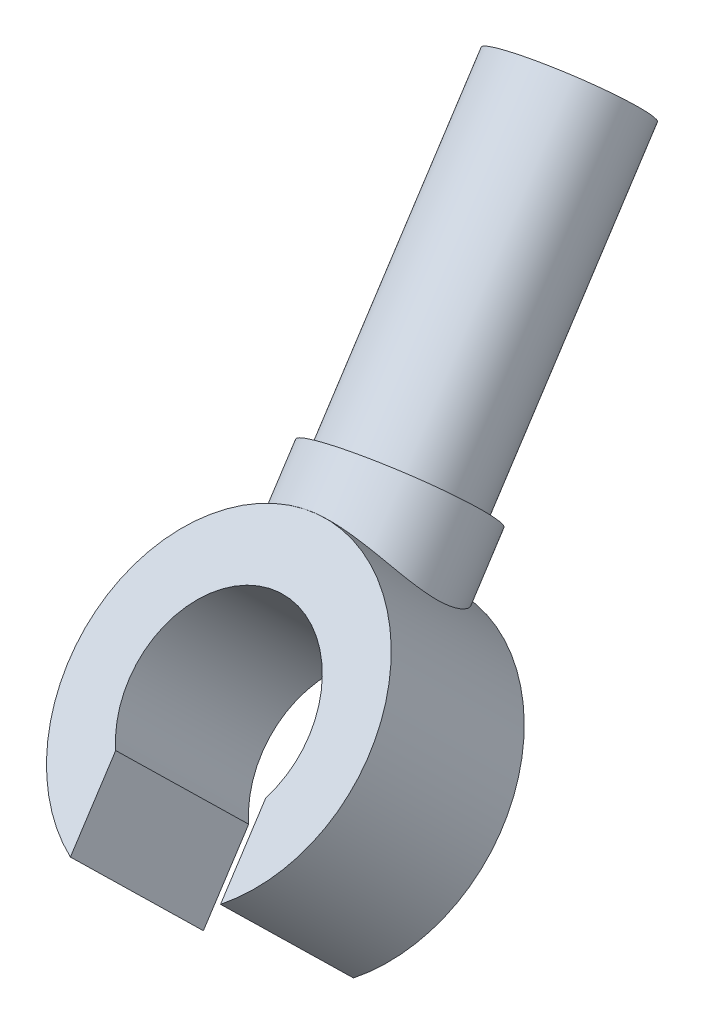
ISO-10303-21;
HEADER;
FILE_DESCRIPTION(('STEP AP214'),'2;1');
FILE_NAME('part.step','',(''),(''),'','','');
FILE_SCHEMA(('AUTOMOTIVE_DESIGN { 1 0 10303 214 1 1 1 1 }'));
ENDSEC;
DATA;
#1=APPLICATION_CONTEXT('core data for automotive mechanical design processes');
#2=APPLICATION_PROTOCOL_DEFINITION('international standard','automotive_design',2000,#1);
#3=PRODUCT_CONTEXT('',#1,'mechanical');
#4=PRODUCT('Part','Part','',(#3));
#5=PRODUCT_RELATED_PRODUCT_CATEGORY('part','',(#4));
#6=PRODUCT_DEFINITION_FORMATION('','',#4);
#7=PRODUCT_DEFINITION_CONTEXT('part definition',#1,'design');
#8=PRODUCT_DEFINITION('design','',#6,#7);
#9=PRODUCT_DEFINITION_SHAPE('','',#8);
#10=(LENGTH_UNIT() NAMED_UNIT(*) SI_UNIT(.MILLI.,.METRE.));
#11=(NAMED_UNIT(*) PLANE_ANGLE_UNIT() SI_UNIT($,.RADIAN.));
#12=(NAMED_UNIT(*) SI_UNIT($,.STERADIAN.) SOLID_ANGLE_UNIT());
#13=UNCERTAINTY_MEASURE_WITH_UNIT(LENGTH_MEASURE(1.E-05),#10,'distance_accuracy_value','');
#14=(GEOMETRIC_REPRESENTATION_CONTEXT(3) GLOBAL_UNCERTAINTY_ASSIGNED_CONTEXT((#13)) GLOBAL_UNIT_ASSIGNED_CONTEXT((#10,
#11,#12)) REPRESENTATION_CONTEXT('',''));
#15=CARTESIAN_POINT('',(0.,0.,0.));
#16=DIRECTION('',(0.,0.,1.));
#17=DIRECTION('',(1.,0.,0.));
#18=AXIS2_PLACEMENT_3D('',#15,#16,#17);
#19=CARTESIAN_POINT('',(15.2915894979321,14.3818385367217,7.90626678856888));
#20=DIRECTION('',(0.975131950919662,0.221625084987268,0.));
#21=DIRECTION('',(-0.156712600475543,0.689522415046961,0.707106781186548));
#22=AXIS2_PLACEMENT_3D('',#19,#20,#21);
#23=PLANE('',#22);
#24=DIRECTION('',(-0.156712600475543,0.689522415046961,0.707106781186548));
#25=VECTOR('',#24,1.);
#26=CARTESIAN_POINT('',(15.2033138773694,14.7702439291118,7.50795618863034));
#27=LINE('',#26,#25);
#28=CARTESIAN_POINT('',(15.5950953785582,13.0464378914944,5.74018923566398));
#29=VERTEX_POINT('',#28);
#30=CARTESIAN_POINT('',(15.2033138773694,14.7702439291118,7.50795618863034));
#31=VERTEX_POINT('',#30);
#32=EDGE_CURVE('E117',#29,#31,#27,.T.);
#33=ORIENTED_EDGE('',*,*,#32,.T.);
#34=DIRECTION('',(0.156712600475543,-0.689522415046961,0.707106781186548));
#35=VECTOR('',#34,1.);
#36=CARTESIAN_POINT('',(15.2915894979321,14.3818385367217,7.90626678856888));
#37=LINE('',#36,#35);
#38=CARTESIAN_POINT('',(14.9939603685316,15.6913819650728,6.56332706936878));
#39=VERTEX_POINT('',#38);
#40=EDGE_CURVE('E11',#39,#31,#37,.T.);
#41=ORIENTED_EDGE('',*,*,#40,.F.);
#42=DIRECTION('',(0.156712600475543,-0.689522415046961,-0.707106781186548));
#43=VECTOR('',#42,1.);
#44=CARTESIAN_POINT('',(14.9939603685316,15.6913819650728,6.56332706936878));
#45=LINE('',#44,#43);
#46=CARTESIAN_POINT('',(15.3857418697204,13.9675759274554,4.79556011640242));
#47=VERTEX_POINT('',#46);
#48=EDGE_CURVE('E120',#39,#47,#45,.T.);
#49=ORIENTED_EDGE('',*,*,#48,.T.);
#50=DIRECTION('',(0.156712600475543,-0.689522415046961,0.707106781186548));
#51=VECTOR('',#50,1.);
#52=CARTESIAN_POINT('',(15.6833709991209,12.6580324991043,6.13849983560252));
#53=LINE('',#52,#51);
#54=EDGE_CURVE('E107',#47,#29,#53,.T.);
#55=ORIENTED_EDGE('',*,*,#54,.T.);
#56=EDGE_LOOP('',(#33,#41,#49,#55));
#57=FACE_BOUND('',#56,.T.);
#58=ADVANCED_FACE('F17',(#57),#23,.F.);
#59=CARTESIAN_POINT('',(12.5561304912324,15.1373192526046,6.56332706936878));
#60=DIRECTION('',(-0.975131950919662,-0.221625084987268,0.));
#61=DIRECTION('',(0.156712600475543,-0.689522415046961,0.707106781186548));
#62=AXIS2_PLACEMENT_3D('',#59,#60,#61);
#63=PLANE('',#62);
#64=DIRECTION('',(0.156712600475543,-0.689522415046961,-0.707106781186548));
#65=VECTOR('',#64,1.);
#66=CARTESIAN_POINT('',(12.7654840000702,14.2161812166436,7.50795618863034));
#67=LINE('',#66,#65);
#68=CARTESIAN_POINT('',(12.7654840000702,14.2161812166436,7.50795618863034));
#69=VERTEX_POINT('',#68);
#70=CARTESIAN_POINT('',(13.1572655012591,12.4923751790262,5.74018923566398));
#71=VERTEX_POINT('',#70);
#72=EDGE_CURVE('E153',#69,#71,#67,.T.);
#73=ORIENTED_EDGE('',*,*,#72,.T.);
#74=DIRECTION('',(-0.156712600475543,0.689522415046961,-0.707106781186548));
#75=VECTOR('',#74,1.);
#76=CARTESIAN_POINT('',(12.9479119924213,13.4135132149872,4.79556011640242));
#77=LINE('',#76,#75);
#78=CARTESIAN_POINT('',(12.9479119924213,13.4135132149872,4.79556011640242));
#79=VERTEX_POINT('',#78);
#80=EDGE_CURVE('E168',#71,#79,#77,.T.);
#81=ORIENTED_EDGE('',*,*,#80,.T.);
#82=DIRECTION('',(0.156712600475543,-0.689522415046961,-0.707106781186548));
#83=VECTOR('',#82,1.);
#84=CARTESIAN_POINT('',(12.5561304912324,15.1373192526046,6.56332706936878));
#85=LINE('',#84,#83);
#86=CARTESIAN_POINT('',(12.5561304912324,15.1373192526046,6.56332706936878));
#87=VERTEX_POINT('',#86);
#88=EDGE_CURVE('E128',#87,#79,#85,.T.);
#89=ORIENTED_EDGE('',*,*,#88,.F.);
#90=DIRECTION('',(-0.156712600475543,0.689522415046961,-0.707106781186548));
#91=VECTOR('',#90,1.);
#92=CARTESIAN_POINT('',(12.5561304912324,15.1373192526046,6.56332706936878));
#93=LINE('',#92,#91);
#94=EDGE_CURVE('E28',#69,#87,#93,.T.);
#95=ORIENTED_EDGE('',*,*,#94,.F.);
#96=EDGE_LOOP('',(#73,#81,#89,#95));
#97=FACE_BOUND('',#96,.T.);
#98=ADVANCED_FACE('F300',(#97),#63,.F.);
#99=CARTESIAN_POINT('',(13.6451062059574,15.9860723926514,5.97702509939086));
#100=DIRECTION('',(0.156712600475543,-0.689522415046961,-0.707106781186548));
#101=DIRECTION('',(-0.156712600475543,0.689522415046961,-0.707106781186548));
#102=AXIS2_PLACEMENT_3D('',#99,#100,#101);
#103=PLANE('',#102);
#104=CARTESIAN_POINT('',(13.6451062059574,15.9860723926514,5.97702509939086));
#105=DIRECTION('',(0.156712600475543,-0.689522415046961,-0.707106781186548));
#106=DIRECTION('',(-0.156712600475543,0.689522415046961,-0.707106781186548));
#107=AXIS2_PLACEMENT_3D('',#104,#105,#106);
#108=CIRCLE('',#107,2.5);
#109=CARTESIAN_POINT('',(13.2533247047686,17.7098784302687,4.20925814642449));
#110=VERTEX_POINT('',#109);
#111=EDGE_CURVE('E157',#69,#110,#108,.T.);
#112=ORIENTED_EDGE('',*,*,#111,.F.);
#113=ORIENTED_EDGE('',*,*,#94,.T.);
#114=CARTESIAN_POINT('',(13.6451062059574,15.9860723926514,5.97702509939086));
#115=DIRECTION('',(0.156712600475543,-0.689522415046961,-0.707106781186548));
#116=DIRECTION('',(-0.156712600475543,0.689522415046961,-0.707106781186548));
#117=AXIS2_PLACEMENT_3D('',#114,#115,#116);
#118=CIRCLE('',#117,1.5);
#119=EDGE_CURVE('E135',#87,#39,#118,.T.);
#120=ORIENTED_EDGE('',*,*,#119,.T.);
#121=ORIENTED_EDGE('',*,*,#40,.T.);
#122=CARTESIAN_POINT('',(13.6451062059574,15.9860723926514,5.97702509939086));
#123=DIRECTION('',(0.156712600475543,-0.689522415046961,-0.707106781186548));
#124=DIRECTION('',(-0.156712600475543,0.689522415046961,-0.707106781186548));
#125=AXIS2_PLACEMENT_3D('',#122,#123,#124);
#126=CIRCLE('',#125,2.5);
#127=EDGE_CURVE('E144',#110,#31,#126,.T.);
#128=ORIENTED_EDGE('',*,*,#127,.F.);
#129=EDGE_LOOP('',(#112,#113,#120,#121,#128));
#130=FACE_BOUND('',#129,.T.);
#131=ADVANCED_FACE('F298',(#130),#103,.F.);
#132=CARTESIAN_POINT('',(13.6451062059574,15.9860723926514,5.97702509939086));
#133=DIRECTION('',(0.156712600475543,-0.689522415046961,-0.707106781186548));
#134=DIRECTION('',(-0.156712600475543,0.689522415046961,-0.707106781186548));
#135=AXIS2_PLACEMENT_3D('',#132,#133,#134);
#136=CYLINDRICAL_SURFACE('',#135,2.5);
#137=ORIENTED_EDGE('',*,*,#32,.F.);
#138=CARTESIAN_POINT('',(14.0368877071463,14.2622663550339,4.20925814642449));
#139=DIRECTION('',(0.156712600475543,-0.689522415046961,-0.707106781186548));
#140=DIRECTION('',(-0.156712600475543,0.689522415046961,-0.707106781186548));
#141=AXIS2_PLACEMENT_3D('',#138,#139,#140);
#142=CIRCLE('',#141,2.5);
#143=CARTESIAN_POINT('',(14.1405877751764,16.0620569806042,2.47720733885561));
#144=VERTEX_POINT('',#143);
#145=EDGE_CURVE('E113',#144,#29,#142,.T.);
#146=ORIENTED_EDGE('',*,*,#145,.F.);
#147=CARTESIAN_POINT('',(14.7818575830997,16.8502228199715,3.54781939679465));
#148=CARTESIAN_POINT('',(14.7838177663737,16.8415987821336,3.53897540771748));
#149=CARTESIAN_POINT('',(14.7855837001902,16.8330138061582,3.53005044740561));
#150=CARTESIAN_POINT('',(14.7887399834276,16.8158557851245,3.51197654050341));
#151=CARTESIAN_POINT('',(14.790127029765,16.8072834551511,3.50282633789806));
#152=CARTESIAN_POINT('',(14.792515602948,16.7901564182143,3.48430974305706));
#153=CARTESIAN_POINT('',(14.7935136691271,16.7816025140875,3.47494216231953));
#154=CARTESIAN_POINT('',(14.7951147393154,16.7645183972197,3.45599889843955));
#155=CARTESIAN_POINT('',(14.7957141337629,16.7559890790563,3.44642210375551));
#156=CARTESIAN_POINT('',(14.7965084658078,16.7389606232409,3.42706886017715));
#157=CARTESIAN_POINT('',(14.7966996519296,16.7304624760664,3.41729138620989));
#158=CARTESIAN_POINT('',(14.7966684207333,16.7135032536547,3.3975455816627));
#159=CARTESIAN_POINT('',(14.7964421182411,16.7050432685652,3.38757632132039));
#160=CARTESIAN_POINT('',(14.7955670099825,16.688167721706,3.36745606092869));
#161=CARTESIAN_POINT('',(14.7949141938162,16.6797533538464,3.35730423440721));
#162=CARTESIAN_POINT('',(14.7931774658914,16.6629766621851,3.33682840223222));
#163=CARTESIAN_POINT('',(14.7920894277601,16.6546156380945,3.32650368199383));
#164=CARTESIAN_POINT('',(14.789473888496,16.6379542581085,3.30569157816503));
#165=CARTESIAN_POINT('',(14.7879421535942,16.6296553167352,3.2952035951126));
#166=CARTESIAN_POINT('',(14.784431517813,16.6131249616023,3.27407627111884));
#167=CARTESIAN_POINT('',(14.7824482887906,16.6048950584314,3.26343646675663));
#168=CARTESIAN_POINT('',(14.7784449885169,16.5900696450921,3.24404108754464));
#169=CARTESIAN_POINT('',(14.7764959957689,16.5834469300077,3.23529157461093));
#170=CARTESIAN_POINT('',(14.7722327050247,16.5700655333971,3.21745036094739));
#171=CARTESIAN_POINT('',(14.7699074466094,16.5633110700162,3.20835813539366));
#172=CARTESIAN_POINT('',(14.7622066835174,16.5424848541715,3.18009111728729));
#173=CARTESIAN_POINT('',(14.7563077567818,16.5286036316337,3.16091476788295));
#174=CARTESIAN_POINT('',(14.7463135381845,16.5077819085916,3.13174221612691));
#175=CARTESIAN_POINT('',(14.7426886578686,16.5006702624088,3.12170305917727));
#176=CARTESIAN_POINT('',(14.7349591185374,16.4863419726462,3.10133791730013));
#177=CARTESIAN_POINT('',(14.7308425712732,16.4791296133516,3.09101340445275));
#178=CARTESIAN_POINT('',(14.7221005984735,16.464611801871,3.07009567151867));
#179=CARTESIAN_POINT('',(14.7174630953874,16.4573107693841,3.0595044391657));
#180=CARTESIAN_POINT('',(14.7076498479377,16.4426287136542,3.03807202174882));
#181=CARTESIAN_POINT('',(14.7024618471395,16.4352522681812,3.02723331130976));
#182=CARTESIAN_POINT('',(14.691518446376,16.4204338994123,3.00532672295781));
#183=CARTESIAN_POINT('',(14.6857506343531,16.4129967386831,2.99426182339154));
#184=CARTESIAN_POINT('',(14.6736186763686,16.3980745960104,2.97192454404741));
#185=CARTESIAN_POINT('',(14.6672419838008,16.3905946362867,2.96065562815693));
#186=CARTESIAN_POINT('',(14.6511383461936,16.372545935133,2.93330758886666));
#187=CARTESIAN_POINT('',(14.6411761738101,16.3620729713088,2.91730346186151));
#188=CARTESIAN_POINT('',(14.6174664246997,16.3385409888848,2.88125055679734));
#189=CARTESIAN_POINT('',(14.6034392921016,16.3255777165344,2.86132214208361));
#190=CARTESIAN_POINT('',(14.5801588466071,16.3054844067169,2.83035169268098));
#191=CARTESIAN_POINT('',(14.5713607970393,16.2981809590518,2.81907694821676));
#192=CARTESIAN_POINT('',(14.5527037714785,16.2832592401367,2.79604124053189));
#193=CARTESIAN_POINT('',(14.5428132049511,16.2756526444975,2.78429828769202));
#194=CARTESIAN_POINT('',(14.5160230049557,16.2558111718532,2.75371045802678));
#195=CARTESIAN_POINT('',(14.4986933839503,16.2437340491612,2.73513677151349));
#196=CARTESIAN_POINT('',(14.4679775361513,16.2235651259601,2.70421508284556));
#197=CARTESIAN_POINT('',(14.4549153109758,16.2153383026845,2.69163126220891));
#198=CARTESIAN_POINT('',(14.4314063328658,16.2010640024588,2.67000583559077));
#199=CARTESIAN_POINT('',(14.4210948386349,16.1949724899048,2.66084619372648));
#200=CARTESIAN_POINT('',(14.4004300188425,16.183099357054,2.64311982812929));
#201=CARTESIAN_POINT('',(14.3900870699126,16.1773139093,2.63454357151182));
#202=CARTESIAN_POINT('',(14.3693988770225,16.1660427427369,2.61796886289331));
#203=CARTESIAN_POINT('',(14.3590634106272,16.1605532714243,2.60996075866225));
#204=CARTESIAN_POINT('',(14.3384274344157,16.1498652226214,2.59450491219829));
#205=CARTESIAN_POINT('',(14.3281361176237,16.1446629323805,2.58704746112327));
#206=CARTESIAN_POINT('',(14.3076232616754,16.1345387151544,2.57267523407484));
#207=CARTESIAN_POINT('',(14.2974103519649,16.1296131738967,2.56575069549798));
#208=CARTESIAN_POINT('',(14.2770875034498,16.1200310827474,2.55242672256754));
#209=CARTESIAN_POINT('',(14.2669856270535,16.1153710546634,2.54601746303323));
#210=CARTESIAN_POINT('',(14.2374105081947,16.102017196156,2.52787425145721));
#211=CARTESIAN_POINT('',(14.2176487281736,16.0934493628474,2.51651360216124));
#212=CARTESIAN_POINT('',(14.1788510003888,16.0772463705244,2.49571472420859));
#213=CARTESIAN_POINT('',(14.1598671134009,16.06958874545,2.48619673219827));
#214=CARTESIAN_POINT('',(14.1405877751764,16.0620569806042,2.47720733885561));
#215=B_SPLINE_CURVE_WITH_KNOTS('',3,(#147,#148,#149,#150,#151,#152,#153,#154,#155,#156,#157,
#158,#159,#160,#161,#162,#163,#164,#165,#166,#167,#168,#169,#170,#171,#172,#173,#174,#175,#176,
#177,#178,#179,#180,#181,#182,#183,#184,#185,#186,#187,#188,#189,#190,#191,#192,#193,#194,#195,
#196,#197,#198,#199,#200,#201,#202,#203,#204,#205,#206,#207,#208,#209,#210,#211,#212,#213,#214),
.UNSPECIFIED.,.F.,.F.,(4,2,2,2,2,2,2,2,2,2,2,2,2,2,2,2,2,2,2,2,2,2,2,2,2,2,2,2,2,2,2,2,2,4),(0.,
0.0375198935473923,0.075357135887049,0.113523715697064,0.152031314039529,0.190891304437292,
0.230114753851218,0.269712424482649,0.309694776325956,0.350071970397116,0.39085387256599,
0.424284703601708,0.458969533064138,0.532111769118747,0.570584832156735,0.61032799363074,
0.651344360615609,0.693636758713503,0.737207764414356,0.782059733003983,0.846732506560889,
0.929489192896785,0.977655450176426,1.02904765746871,1.11337300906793,1.1731043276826,
1.21832882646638,1.2622074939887,1.30474191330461,1.34593382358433,1.38578514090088,
1.42429798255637,1.49731064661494,1.56500232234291),.UNSPECIFIED.);
#216=CARTESIAN_POINT('',(14.7818575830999,16.8502228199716,3.54781939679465));
#217=VERTEX_POINT('',#216);
#218=EDGE_CURVE('E177',#217,#144,#215,.T.);
#219=ORIENTED_EDGE('',*,*,#218,.F.);
#220=CARTESIAN_POINT('',(13.2533247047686,17.7098784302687,4.20925814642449));
#221=CARTESIAN_POINT('',(13.2667652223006,17.7129332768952,4.20925826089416));
#222=CARTESIAN_POINT('',(13.2802588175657,17.7157540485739,4.20918792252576));
#223=CARTESIAN_POINT('',(13.3074451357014,17.7209496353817,4.20890192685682));
#224=CARTESIAN_POINT('',(13.3211385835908,17.7233205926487,4.20868507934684));
#225=CARTESIAN_POINT('',(13.3487118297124,17.7276065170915,4.20809907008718));
#226=CARTESIAN_POINT('',(13.3625922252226,17.729517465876,4.2077286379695));
#227=CARTESIAN_POINT('',(13.3905259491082,17.7328736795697,4.20682893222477));
#228=CARTESIAN_POINT('',(13.404579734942,17.7343147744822,4.20629831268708));
#229=CARTESIAN_POINT('',(13.4328461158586,17.7367216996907,4.20507198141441));
#230=CARTESIAN_POINT('',(13.4470590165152,17.7376832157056,4.2043748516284));
#231=CARTESIAN_POINT('',(13.4756288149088,17.7391216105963,4.20280961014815));
#232=CARTESIAN_POINT('',(13.489985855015,17.7395940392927,4.20194001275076));
#233=CARTESIAN_POINT('',(13.5188284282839,17.7400451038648,4.200024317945));
#234=CARTESIAN_POINT('',(13.5333139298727,17.7400191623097,4.19897667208));
#235=CARTESIAN_POINT('',(13.5623972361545,17.7394645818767,4.19669976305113));
#236=CARTESIAN_POINT('',(13.576994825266,17.7389312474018,4.19546889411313));
#237=CARTESIAN_POINT('',(13.6062854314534,17.7373532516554,4.19282085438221));
#238=CARTESIAN_POINT('',(13.620978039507,17.7363037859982,4.19140202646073));
#239=CARTESIAN_POINT('',(13.6504411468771,17.7336852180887,4.18837382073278));
#240=CARTESIAN_POINT('',(13.6652110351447,17.7321112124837,4.18676274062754));
#241=CARTESIAN_POINT('',(13.6948104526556,17.7284355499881,4.18334633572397));
#242=CARTESIAN_POINT('',(13.7096391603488,17.7263289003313,4.18153927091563));
#243=CARTESIAN_POINT('',(13.7393374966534,17.7215804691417,4.17772744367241));
#244=CARTESIAN_POINT('',(13.7542060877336,17.7189336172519,4.17572090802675));
#245=CARTESIAN_POINT('',(13.7819409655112,17.7134938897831,4.17179464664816));
#246=CARTESIAN_POINT('',(13.7948222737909,17.710761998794,4.16989612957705));
#247=CARTESIAN_POINT('',(13.8209259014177,17.7048172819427,4.16588765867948));
#248=CARTESIAN_POINT('',(13.8341443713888,17.7015909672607,4.16377262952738));
#249=CARTESIAN_POINT('',(13.8608993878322,17.6946302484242,4.15930994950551));
#250=CARTESIAN_POINT('',(13.8744315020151,17.6908823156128,4.15695683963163));
#251=CARTESIAN_POINT('',(13.9017884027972,17.6828507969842,4.15199709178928));
#252=CARTESIAN_POINT('',(13.9156081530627,17.6785536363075,4.14938465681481));
#253=CARTESIAN_POINT('',(13.9435120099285,17.6693955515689,4.14388625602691));
#254=CARTESIAN_POINT('',(13.9575904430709,17.6645209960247,4.14099421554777));
#255=CARTESIAN_POINT('',(13.9859809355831,17.6541815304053,4.13491491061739));
#256=CARTESIAN_POINT('',(14.0002866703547,17.6487029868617,4.13172126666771));
#257=CARTESIAN_POINT('',(14.0252761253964,17.6386583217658,4.12591427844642));
#258=CARTESIAN_POINT('',(14.0360083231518,17.6341870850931,4.12334467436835));
#259=CARTESIAN_POINT('',(14.0582484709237,17.6245991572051,4.11785393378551));
#260=CARTESIAN_POINT('',(14.0697439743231,17.6194600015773,4.11492155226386));
#261=CARTESIAN_POINT('',(14.0934651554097,17.6084827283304,4.10866194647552));
#262=CARTESIAN_POINT('',(14.105676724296,17.6026214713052,4.10532183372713));
#263=CARTESIAN_POINT('',(14.130777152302,17.5901418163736,4.09820418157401));
#264=CARTESIAN_POINT('',(14.1436500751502,17.5834994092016,4.0944125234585));
#265=CARTESIAN_POINT('',(14.1700125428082,17.56939874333,4.08634557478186));
#266=CARTESIAN_POINT('',(14.1834841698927,17.5619157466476,4.0820549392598));
#267=CARTESIAN_POINT('',(14.2109736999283,17.5460667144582,4.07295316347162));
#268=CARTESIAN_POINT('',(14.2249714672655,17.5376748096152,4.0681262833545));
#269=CARTESIAN_POINT('',(14.2558752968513,17.5184488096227,4.05699964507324));
#270=CARTESIAN_POINT('',(14.2726861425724,17.5075065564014,4.05062155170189));
#271=CARTESIAN_POINT('',(14.3036555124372,17.486449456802,4.03822094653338));
#272=CARTESIAN_POINT('',(14.3178825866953,17.4764025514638,4.03225390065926));
#273=CARTESIAN_POINT('',(14.3438643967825,17.4573431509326,4.02085537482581));
#274=CARTESIAN_POINT('',(14.3556815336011,17.4483884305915,4.01546948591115));
#275=CARTESIAN_POINT('',(14.3770130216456,17.4316953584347,4.00536681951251));
#276=CARTESIAN_POINT('',(14.3865822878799,17.4240036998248,4.00068856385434));
#277=CARTESIAN_POINT('',(14.4092255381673,17.4053144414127,3.98925593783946));
#278=CARTESIAN_POINT('',(14.4221775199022,17.3942201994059,3.9824167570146));
#279=CARTESIAN_POINT('',(14.4459366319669,17.373167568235,3.96919031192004));
#280=CARTESIAN_POINT('',(14.456806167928,17.3632454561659,3.96285717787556));
#281=CARTESIAN_POINT('',(14.477709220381,17.3435515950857,3.95015261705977));
#282=CARTESIAN_POINT('',(14.4877587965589,17.3337894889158,3.94379267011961));
#283=CARTESIAN_POINT('',(14.5070570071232,17.314466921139,3.93105432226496));
#284=CARTESIAN_POINT('',(14.5163215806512,17.3049147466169,3.92468749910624));
#285=CARTESIAN_POINT('',(14.5340855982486,17.2860491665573,3.91196870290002));
#286=CARTESIAN_POINT('',(14.5426008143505,17.2767431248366,3.90562783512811));
#287=CARTESIAN_POINT('',(14.5589027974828,17.2584070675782,3.89298674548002));
#288=CARTESIAN_POINT('',(14.566705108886,17.2493833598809,3.88669742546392));
#289=CARTESIAN_POINT('',(14.5816182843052,17.2316452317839,3.87418453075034));
#290=CARTESIAN_POINT('',(14.5887444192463,17.2229360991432,3.86797165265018));
#291=CARTESIAN_POINT('',(14.6041458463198,17.2035950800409,3.85399312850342));
#292=CARTESIAN_POINT('',(14.6123486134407,17.192943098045,3.84617515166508));
#293=CARTESIAN_POINT('',(14.6281690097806,17.1716796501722,3.83032150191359));
#294=CARTESIAN_POINT('',(14.6357931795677,17.1610696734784,3.82229035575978));
#295=CARTESIAN_POINT('',(14.6504629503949,17.1399079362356,3.80602763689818));
#296=CARTESIAN_POINT('',(14.6575150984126,17.1293574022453,3.79780037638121));
#297=CARTESIAN_POINT('',(14.6710481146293,17.108332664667,3.78116101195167));
#298=CARTESIAN_POINT('',(14.6775355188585,17.0978594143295,3.77275302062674));
#299=CARTESIAN_POINT('',(14.6899472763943,17.0770065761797,3.75576731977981));
#300=CARTESIAN_POINT('',(14.6958781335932,17.0666276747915,3.74719352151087));
#301=CARTESIAN_POINT('',(14.7071858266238,17.0459803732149,3.72989054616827));
#302=CARTESIAN_POINT('',(14.7125691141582,17.0357123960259,3.72116508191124));
#303=CARTESIAN_POINT('',(14.7227914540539,17.0153031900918,3.70357241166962));
#304=CARTESIAN_POINT('',(14.7276368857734,17.0051621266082,3.69470872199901));
#305=CARTESIAN_POINT('',(14.7367939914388,16.985022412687,3.67685251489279));
#306=CARTESIAN_POINT('',(14.7411119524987,16.975023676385,3.66786331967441));
#307=CARTESIAN_POINT('',(14.7492252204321,16.9551836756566,3.64976829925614));
#308=CARTESIAN_POINT('',(14.753026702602,16.9453420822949,3.6406656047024));
#309=CARTESIAN_POINT('',(14.7601187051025,16.9258308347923,3.62235507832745));
#310=CARTESIAN_POINT('',(14.7634152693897,16.9161606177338,3.61315018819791));
#311=CARTESIAN_POINT('',(14.7695095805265,16.8970059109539,3.5946460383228));
#312=CARTESIAN_POINT('',(14.772313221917,16.8875206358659,3.58534953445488));
#313=CARTESIAN_POINT('',(14.7774345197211,16.8687492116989,3.56667230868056));
#314=CARTESIAN_POINT('',(14.7797578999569,16.859462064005,3.55729415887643));
#315=CARTESIAN_POINT('',(14.7818575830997,16.8502228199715,3.54781939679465));
#316=B_SPLINE_CURVE_WITH_KNOTS('',3,(#220,#221,#222,#223,#224,#225,#226,#227,#228,#229,#230,
#231,#232,#233,#234,#235,#236,#237,#238,#239,#240,#241,#242,#243,#244,#245,#246,#247,#248,#249,
#250,#251,#252,#253,#254,#255,#256,#257,#258,#259,#260,#261,#262,#263,#264,#265,#266,#267,#268,
#269,#270,#271,#272,#273,#274,#275,#276,#277,#278,#279,#280,#281,#282,#283,#284,#285,#286,#287,
#288,#289,#290,#291,#292,#293,#294,#295,#296,#297,#298,#299,#300,#301,#302,#303,#304,#305,#306,
#307,#308,#309,#310,#311,#312,#313,#314,#315),.UNSPECIFIED.,.F.,.F.,(4,2,2,2,2,2,2,2,2,2,2,2,2,
2,2,2,2,2,2,2,2,2,2,2,2,2,2,2,2,2,2,2,2,2,2,2,2,2,2,2,2,2,2,2,2,2,2,4),(0.,0.0413474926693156,
0.0830349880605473,0.125074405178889,0.167477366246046,0.210255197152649,0.253418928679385,
0.296979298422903,0.340946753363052,0.385331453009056,0.43014327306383,0.475391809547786,
0.521086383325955,0.560991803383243,0.602294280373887,0.644998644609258,0.68910926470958,
0.734630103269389,0.781564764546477,0.817281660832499,0.856063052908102,0.897909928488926,
0.942823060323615,0.990803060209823,1.04185041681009,1.10497187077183,1.1601901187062,
1.20750476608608,1.24691550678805,1.30202196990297,1.35007809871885,1.39622835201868,
1.44047535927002,1.48282210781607,1.52327200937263,1.5618289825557,1.60847424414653,
1.65447218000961,1.69983350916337,1.74456940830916,1.78869152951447,1.83221201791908,
1.87514352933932,1.9174992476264,1.95929290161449,2.00053878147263,2.04125175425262,
2.08144727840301),.UNSPECIFIED.);
#317=EDGE_CURVE('E267',#110,#217,#316,.T.);
#318=ORIENTED_EDGE('',*,*,#317,.F.);
#319=ORIENTED_EDGE('',*,*,#127,.T.);
#320=EDGE_LOOP('',(#137,#146,#219,#318,#319));
#321=FACE_BOUND('',#320,.T.);
#322=ADVANCED_FACE('F288',(#321),#136,.T.);
#323=CARTESIAN_POINT('',(13.4805579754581,16.7100709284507,3.39608534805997));
#324=DIRECTION('',(0.156712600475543,-0.689522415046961,0.707106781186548));
#325=DIRECTION('',(0.975131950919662,0.221625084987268,0.));
#326=AXIS2_PLACEMENT_3D('',#323,#324,#325);
#327=PLANE('',#326);
#328=CARTESIAN_POINT('',(13.4805579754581,16.7100709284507,3.39608534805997));
#329=DIRECTION('',(0.156712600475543,-0.689522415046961,0.707106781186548));
#330=DIRECTION('',(0.975131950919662,0.221625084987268,0.));
#331=AXIS2_PLACEMENT_3D('',#328,#329,#330);
#332=CIRCLE('',#331,1.30000000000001);
#333=CARTESIAN_POINT('',(13.1810471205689,15.7718314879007,2.5475572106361));
#334=VERTEX_POINT('',#333);
#335=CARTESIAN_POINT('',(14.1561790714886,15.993456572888,2.5475572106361));
#336=VERTEX_POINT('',#335);
#337=EDGE_CURVE('E158',#334,#336,#332,.T.);
#338=ORIENTED_EDGE('',*,*,#337,.T.);
#339=DIRECTION('',(-0.975131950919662,-0.221625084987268,0.));
#340=VECTOR('',#339,1.);
#341=CARTESIAN_POINT('',(13.1810471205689,15.7718314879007,2.5475572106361));
#342=LINE('',#341,#340);
#343=EDGE_CURVE('E165',#336,#334,#342,.T.);
#344=ORIENTED_EDGE('',*,*,#343,.T.);
#345=EDGE_LOOP('',(#338,#344));
#346=FACE_BOUND('',#345,.T.);
#347=ADVANCED_FACE('F297',(#346),#327,.T.);
#348=CARTESIAN_POINT('',(13.1810471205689,15.7718314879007,2.5475572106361));
#349=DIRECTION('',(-0.156712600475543,0.689522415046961,0.707106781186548));
#350=DIRECTION('',(0.975131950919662,0.221625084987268,0.));
#351=AXIS2_PLACEMENT_3D('',#348,#349,#350);
#352=PLANE('',#351);
#353=CARTESIAN_POINT('',(14.0368877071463,14.2622663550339,4.20925814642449));
#354=DIRECTION('',(0.156712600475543,-0.689522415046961,-0.707106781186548));
#355=DIRECTION('',(-0.156712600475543,0.689522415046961,-0.707106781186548));
#356=AXIS2_PLACEMENT_3D('',#353,#354,#355);
#357=CIRCLE('',#356,1.5);
#358=EDGE_CURVE('E110',#79,#47,#357,.T.);
#359=ORIENTED_EDGE('',*,*,#358,.F.);
#360=ORIENTED_EDGE('',*,*,#80,.F.);
#361=CARTESIAN_POINT('',(14.0368877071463,14.2622663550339,4.20925814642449));
#362=DIRECTION('',(0.156712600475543,-0.689522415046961,-0.707106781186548));
#363=DIRECTION('',(-0.156712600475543,0.689522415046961,-0.707106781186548));
#364=AXIS2_PLACEMENT_3D('',#361,#362,#363);
#365=CIRCLE('',#364,2.5);
#366=CARTESIAN_POINT('',(13.1654558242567,15.840431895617,2.47720733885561));
#367=VERTEX_POINT('',#366);
#368=EDGE_CURVE('E170',#71,#367,#365,.T.);
#369=ORIENTED_EDGE('',*,*,#368,.T.);
#370=DIRECTION('',(-0.156712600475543,0.689522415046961,-0.707106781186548));
#371=VECTOR('',#370,1.);
#372=CARTESIAN_POINT('',(13.2202252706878,15.5994508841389,2.72433390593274));
#373=LINE('',#372,#371);
#374=EDGE_CURVE('E150',#334,#367,#373,.T.);
#375=ORIENTED_EDGE('',*,*,#374,.F.);
#376=ORIENTED_EDGE('',*,*,#343,.F.);
#377=DIRECTION('',(0.156712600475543,-0.689522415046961,0.707106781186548));
#378=VECTOR('',#377,1.);
#379=CARTESIAN_POINT('',(14.1953572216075,15.8210759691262,2.72433390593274));
#380=LINE('',#379,#378);
#381=EDGE_CURVE('E161',#144,#336,#380,.T.);
#382=ORIENTED_EDGE('',*,*,#381,.F.);
#383=ORIENTED_EDGE('',*,*,#145,.T.);
#384=ORIENTED_EDGE('',*,*,#54,.F.);
#385=EDGE_LOOP('',(#359,#360,#369,#375,#376,#382,#383,#384));
#386=FACE_BOUND('',#385,.T.);
#387=ADVANCED_FACE('F19',(#386),#352,.F.);
#388=CARTESIAN_POINT('',(13.3316810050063,17.3651172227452,2.72433390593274));
#389=DIRECTION('',(0.156712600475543,-0.689522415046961,0.707106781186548));
#390=DIRECTION('',(0.975131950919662,0.221625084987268,0.));
#391=AXIS2_PLACEMENT_3D('',#388,#389,#390);
#392=PLANE('',#391);
#393=CARTESIAN_POINT('',(13.3316810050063,17.3651172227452,2.72433390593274));
#394=DIRECTION('',(0.156712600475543,-0.689522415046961,0.707106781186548));
#395=DIRECTION('',(0.975131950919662,0.221625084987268,0.));
#396=AXIS2_PLACEMENT_3D('',#393,#394,#395);
#397=CIRCLE('',#396,1.1);
#398=CARTESIAN_POINT('',(12.2590358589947,17.1213296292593,2.72433390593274));
#399=VERTEX_POINT('',#398);
#400=EDGE_CURVE('E138',#399,#399,#397,.T.);
#401=ORIENTED_EDGE('',*,*,#400,.T.);
#402=EDGE_LOOP('',(#401));
#403=FACE_BOUND('',#402,.T.);
#404=CARTESIAN_POINT('',(13.3316810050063,17.3651172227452,2.72433390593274));
#405=DIRECTION('',(0.156712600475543,-0.689522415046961,0.707106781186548));
#406=DIRECTION('',(0.975131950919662,0.221625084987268,0.));
#407=AXIS2_PLACEMENT_3D('',#404,#405,#406);
#408=CIRCLE('',#407,1.3);
#409=CARTESIAN_POINT('',(12.0640094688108,17.0770046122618,2.72433390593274));
#410=VERTEX_POINT('',#409);
#411=EDGE_CURVE('E141',#410,#410,#408,.T.);
#412=ORIENTED_EDGE('',*,*,#411,.F.);
#413=EDGE_LOOP('',(#412));
#414=FACE_BOUND('',#413,.T.);
#415=ADVANCED_FACE('F326',(#403,#414),#392,.F.);
#416=CARTESIAN_POINT('',(12.5481180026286,20.81272929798,-0.8112));
#417=DIRECTION('',(0.156712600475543,-0.689522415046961,0.707106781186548));
#418=DIRECTION('',(0.975131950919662,0.221625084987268,0.));
#419=AXIS2_PLACEMENT_3D('',#416,#417,#418);
#420=PLANE('',#419);
#421=CARTESIAN_POINT('',(12.5481180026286,20.81272929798,-0.8112));
#422=DIRECTION('',(0.156712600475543,-0.689522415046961,0.707106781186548));
#423=DIRECTION('',(0.975131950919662,0.221625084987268,0.));
#424=AXIS2_PLACEMENT_3D('',#421,#422,#423);
#425=CIRCLE('',#424,1.1);
#426=CARTESIAN_POINT('',(11.475472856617,20.5689417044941,-0.8112));
#427=VERTEX_POINT('',#426);
#428=EDGE_CURVE('E140',#427,#427,#425,.T.);
#429=ORIENTED_EDGE('',*,*,#428,.F.);
#430=EDGE_LOOP('',(#429));
#431=FACE_BOUND('',#430,.T.);
#432=ADVANCED_FACE('F236',(#431),#420,.F.);
#433=CARTESIAN_POINT('',(13.6451062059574,15.9860723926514,5.97702509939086));
#434=DIRECTION('',(0.156712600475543,-0.689522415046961,-0.707106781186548));
#435=DIRECTION('',(-0.156712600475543,0.689522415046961,-0.707106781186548));
#436=AXIS2_PLACEMENT_3D('',#433,#434,#435);
#437=CYLINDRICAL_SURFACE('',#436,2.5);
#438=ORIENTED_EDGE('',*,*,#72,.F.);
#439=ORIENTED_EDGE('',*,*,#111,.T.);
#440=CARTESIAN_POINT('',(12.2465145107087,16.273997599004,3.54781939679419));
#441=CARTESIAN_POINT('',(12.2444137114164,16.2832401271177,3.55729760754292));
#442=CARTESIAN_POINT('',(12.2424940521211,16.2926226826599,3.5666790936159));
#443=CARTESIAN_POINT('',(12.2389976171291,16.3117713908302,3.58536325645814));
#444=CARTESIAN_POINT('',(12.2374255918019,16.3215409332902,3.59466334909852));
#445=CARTESIAN_POINT('',(12.2346413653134,16.3414573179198,3.6131749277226));
#446=CARTESIAN_POINT('',(12.2334341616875,16.3516074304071,3.62238364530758));
#447=CARTESIAN_POINT('',(12.2313960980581,16.3722780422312,3.64070206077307));
#448=CARTESIAN_POINT('',(12.2305704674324,16.3828016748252,3.64980880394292));
#449=CARTESIAN_POINT('',(12.2293119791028,16.4042116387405,3.66791213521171));
#450=CARTESIAN_POINT('',(12.2288845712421,16.4151009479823,3.6769055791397));
#451=CARTESIAN_POINT('',(12.2284387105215,16.4372338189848,3.69477047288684));
#452=CARTESIAN_POINT('',(12.2284259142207,16.4484801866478,3.70363858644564));
#453=CARTESIAN_POINT('',(12.2288251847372,16.4713179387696,3.72124026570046));
#454=CARTESIAN_POINT('',(12.2292431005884,16.4829119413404,3.72997030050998));
#455=CARTESIAN_POINT('',(12.2305193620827,16.5064349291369,3.74728254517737));
#456=CARTESIAN_POINT('',(12.2313837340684,16.5183663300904,3.75586102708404));
#457=CARTESIAN_POINT('',(12.2335680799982,16.542553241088,3.77285619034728));
#458=CARTESIAN_POINT('',(12.2348942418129,16.5548109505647,3.78126894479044));
#459=CARTESIAN_POINT('',(12.2380168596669,16.5796388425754,3.79791787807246));
#460=CARTESIAN_POINT('',(12.2398196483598,16.5922109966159,3.80614992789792));
#461=CARTESIAN_POINT('',(12.2439097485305,16.6176550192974,3.82242226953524));
#462=CARTESIAN_POINT('',(12.2462035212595,16.6305286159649,3.83045823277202));
#463=CARTESIAN_POINT('',(12.2512889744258,16.6565629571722,3.84632133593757));
#464=CARTESIAN_POINT('',(12.2540872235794,16.6697251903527,3.85414392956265));
#465=CARTESIAN_POINT('',(12.2596340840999,16.6938759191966,3.86814993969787));
#466=CARTESIAN_POINT('',(12.2623094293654,16.7048514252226,3.87438499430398));
#467=CARTESIAN_POINT('',(12.268118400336,16.7273678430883,3.8869363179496));
#468=CARTESIAN_POINT('',(12.2712678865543,16.7389105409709,3.89324205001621));
#469=CARTESIAN_POINT('',(12.2780707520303,16.762549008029,3.90591002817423));
#470=CARTESIAN_POINT('',(12.2817406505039,16.7746457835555,3.91226152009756));
#471=CARTESIAN_POINT('',(12.2896314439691,16.7993763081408,3.9249959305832));
#472=CARTESIAN_POINT('',(12.2938694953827,16.8120102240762,3.93136789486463));
#473=CARTESIAN_POINT('',(12.3029429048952,16.8377987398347,3.94411088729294));
#474=CARTESIAN_POINT('',(12.3077959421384,16.8509527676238,3.95047048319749));
#475=CARTESIAN_POINT('',(12.3181511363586,16.8777523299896,3.96316997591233));
#476=CARTESIAN_POINT('',(12.3236716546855,16.8913961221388,3.96949857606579));
#477=CARTESIAN_POINT('',(12.3359103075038,16.920408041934,3.98260290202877));
#478=CARTESIAN_POINT('',(12.3426910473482,16.9357714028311,3.98933088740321));
#479=CARTESIAN_POINT('',(12.3549180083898,16.9621762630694,4.00065747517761));
#480=CARTESIAN_POINT('',(12.3602218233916,16.9732502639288,4.00533507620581));
#481=CARTESIAN_POINT('',(12.3722803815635,16.9976068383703,4.01547007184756));
#482=CARTESIAN_POINT('',(12.3791076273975,17.0108702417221,4.02088756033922));
#483=CARTESIAN_POINT('',(12.3944301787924,17.0395255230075,4.03237828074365));
#484=CARTESIAN_POINT('',(12.4030103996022,17.0548910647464,4.03840400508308));
#485=CARTESIAN_POINT('',(12.4220817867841,17.0876502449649,4.05094448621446));
#486=CARTESIAN_POINT('',(12.4326685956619,17.1050105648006,4.05740122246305));
#487=CARTESIAN_POINT('',(12.4524919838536,17.1360502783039,4.06863685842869));
#488=CARTESIAN_POINT('',(12.4615903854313,17.1497885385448,4.07349774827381));
#489=CARTESIAN_POINT('',(12.4796973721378,17.1761348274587,4.08263837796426));
#490=CARTESIAN_POINT('',(12.4886741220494,17.1887587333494,4.08693538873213));
#491=CARTESIAN_POINT('',(12.5064330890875,17.2129097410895,4.09499104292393));
#492=CARTESIAN_POINT('',(12.5151863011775,17.2244526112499,4.09876639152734));
#493=CARTESIAN_POINT('',(12.5324077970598,17.2464711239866,4.10583194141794));
#494=CARTESIAN_POINT('',(12.5408494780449,17.2569626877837,4.10913738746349));
#495=CARTESIAN_POINT('',(12.5573660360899,17.2769113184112,4.1153122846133));
#496=CARTESIAN_POINT('',(12.5654166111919,17.2863842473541,4.11819549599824));
#497=CARTESIAN_POINT('',(12.5810794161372,17.3043264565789,4.12357666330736));
#498=CARTESIAN_POINT('',(12.5886693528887,17.312811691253,4.12608637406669));
#499=CARTESIAN_POINT('',(12.6066213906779,17.3323878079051,4.13180460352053));
#500=CARTESIAN_POINT('',(12.6170700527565,17.343412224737,4.13496969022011));
#501=CARTESIAN_POINT('',(12.6380662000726,17.3648501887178,4.14100832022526));
#502=CARTESIAN_POINT('',(12.6486034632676,17.3752721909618,4.14388741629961));
#503=CARTESIAN_POINT('',(12.6697404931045,17.3955126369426,4.14937351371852));
#504=CARTESIAN_POINT('',(12.6803305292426,17.4053397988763,4.15198582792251));
#505=CARTESIAN_POINT('',(12.7015375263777,17.4244008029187,4.15695541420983));
#506=CARTESIAN_POINT('',(12.7121452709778,17.4336435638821,4.15931780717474));
#507=CARTESIAN_POINT('',(12.7333547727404,17.4515464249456,4.16380612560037));
#508=CARTESIAN_POINT('',(12.743947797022,17.460215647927,4.16593691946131));
#509=CARTESIAN_POINT('',(12.7650965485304,17.4769836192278,4.16998003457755));
#510=CARTESIAN_POINT('',(12.7756440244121,17.4850916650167,4.17189696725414));
#511=CARTESIAN_POINT('',(12.7984004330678,17.5020335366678,4.17583203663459));
#512=CARTESIAN_POINT('',(12.8106458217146,17.5108230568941,4.1778304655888));
#513=CARTESIAN_POINT('',(12.8353369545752,17.5278950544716,4.18162773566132));
#514=CARTESIAN_POINT('',(12.8477795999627,17.5361816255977,4.18342832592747));
#515=CARTESIAN_POINT('',(12.8728444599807,17.5522469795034,4.1868325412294));
#516=CARTESIAN_POINT('',(12.8854638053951,17.5600298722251,4.18843789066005));
#517=CARTESIAN_POINT('',(12.9108619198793,17.5750869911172,4.19145556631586));
#518=CARTESIAN_POINT('',(12.9236380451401,17.5823653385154,4.19286957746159));
#519=CARTESIAN_POINT('',(12.9493299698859,17.5964133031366,4.19550879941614));
#520=CARTESIAN_POINT('',(12.9622433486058,17.6031870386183,4.19673565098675));
#521=CARTESIAN_POINT('',(12.9881905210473,17.6162262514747,4.19900529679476));
#522=CARTESIAN_POINT('',(13.0012221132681,17.6224958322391,4.20004968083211));
#523=CARTESIAN_POINT('',(13.0273869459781,17.6345277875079,4.20195955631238));
#524=CARTESIAN_POINT('',(13.0405181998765,17.6402942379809,4.20282658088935));
#525=CARTESIAN_POINT('',(13.0668641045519,17.6513215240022,4.20438731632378));
#526=CARTESIAN_POINT('',(13.0800769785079,17.6565863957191,4.20508249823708));
#527=CARTESIAN_POINT('',(13.1065684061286,17.666612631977,4.2063055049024));
#528=CARTESIAN_POINT('',(13.1198453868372,17.6713779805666,4.20683473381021));
#529=CARTESIAN_POINT('',(13.1464478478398,17.6804077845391,4.20773215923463));
#530=CARTESIAN_POINT('',(13.1597719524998,17.6846761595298,4.20810168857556));
#531=CARTESIAN_POINT('',(13.1864520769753,17.692715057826,4.20868632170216));
#532=CARTESIAN_POINT('',(13.1998069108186,17.696489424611,4.20890268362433));
#533=CARTESIAN_POINT('',(13.2265323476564,17.703543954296,4.20918806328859));
#534=CARTESIAN_POINT('',(13.2399019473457,17.706827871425,4.20925825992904));
#535=CARTESIAN_POINT('',(13.2533247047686,17.7098784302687,4.20925814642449));
#536=B_SPLINE_CURVE_WITH_KNOTS('',3,(#440,#441,#442,#443,#444,#445,#446,#447,#448,#449,#450,
#451,#452,#453,#454,#455,#456,#457,#458,#459,#460,#461,#462,#463,#464,#465,#466,#467,#468,#469,
#470,#471,#472,#473,#474,#475,#476,#477,#478,#479,#480,#481,#482,#483,#484,#485,#486,#487,#488,
#489,#490,#491,#492,#493,#494,#495,#496,#497,#498,#499,#500,#501,#502,#503,#504,#505,#506,#507,
#508,#509,#510,#511,#512,#513,#514,#515,#516,#517,#518,#519,#520,#521,#522,#523,#524,#525,#526,
#527,#528,#529,#530,#531,#532,#533,#534,#535),.UNSPECIFIED.,.F.,.F.,(4,2,2,2,2,2,2,2,2,2,2,2,2,
2,2,2,2,2,2,2,2,2,2,2,2,2,2,2,2,2,2,2,2,2,2,2,2,2,2,2,2,2,2,2,2,2,2,4),(0.,0.0402101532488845,
0.0809398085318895,0.122204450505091,0.164018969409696,0.206397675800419,0.249354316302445,
0.292902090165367,0.33705366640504,0.38182120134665,0.427216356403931,0.473250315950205,
0.519933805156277,0.558637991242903,0.599205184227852,0.641639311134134,0.685943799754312,
0.732121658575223,0.780175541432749,0.834432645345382,0.873846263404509,0.921448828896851,
0.977239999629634,1.04121933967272,1.09274786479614,1.14096343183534,1.18586649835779,
1.22745765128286,1.26573765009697,1.30070749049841,1.34724402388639,1.39252851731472,
1.43656466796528,1.47935649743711,1.52090838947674,1.56122513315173,1.60683030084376,
1.65199276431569,1.6967218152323,1.74102701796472,1.7849182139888,1.82840552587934,
1.87149936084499,1.91421041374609,1.95654966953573,1.99852840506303,2.04015819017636,
2.08145088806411),.UNSPECIFIED.);
#537=CARTESIAN_POINT('',(12.2465145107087,16.2739975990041,3.54781939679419));
#538=VERTEX_POINT('',#537);
#539=EDGE_CURVE('E220',#538,#110,#536,.T.);
#540=ORIENTED_EDGE('',*,*,#539,.F.);
#541=CARTESIAN_POINT('',(13.1654558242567,15.8404318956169,2.47720733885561));
#542=CARTESIAN_POINT('',(13.1445768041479,15.8388737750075,2.48629939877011));
#543=CARTESIAN_POINT('',(13.1239113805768,15.8375691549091,2.49592630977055));
#544=CARTESIAN_POINT('',(13.0816005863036,15.835429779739,2.51688747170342));
#545=CARTESIAN_POINT('',(13.0599890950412,15.8346347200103,2.52829428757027));
#546=CARTESIAN_POINT('',(13.0274726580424,15.8339302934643,2.546483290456));
#547=CARTESIAN_POINT('',(13.0163592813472,15.8337795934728,2.55288782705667));
#548=CARTESIAN_POINT('',(12.9939468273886,15.8336629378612,2.5661815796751));
#549=CARTESIAN_POINT('',(12.982652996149,15.8337029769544,2.57307971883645));
#550=CARTESIAN_POINT('',(12.9599023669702,15.8339891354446,2.58737626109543));
#551=CARTESIAN_POINT('',(12.9484512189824,15.8342415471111,2.59478352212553));
#552=CARTESIAN_POINT('',(12.9254101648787,15.8349737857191,2.61011386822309));
#553=CARTESIAN_POINT('',(12.9138263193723,15.8354601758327,2.61804575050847));
#554=CARTESIAN_POINT('',(12.8905466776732,15.8366810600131,2.63444078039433));
#555=CARTESIAN_POINT('',(12.8788573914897,15.837422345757,2.64291266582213));
#556=CARTESIAN_POINT('',(12.8553945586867,15.8391763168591,2.66040049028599));
#557=CARTESIAN_POINT('',(12.8436279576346,15.8401960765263,2.66942503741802));
#558=CARTESIAN_POINT('',(12.8162442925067,15.8428938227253,2.69103843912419));
#559=CARTESIAN_POINT('',(12.8007400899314,15.8446770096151,2.70375726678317));
#560=CARTESIAN_POINT('',(12.7641511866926,15.8495917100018,2.73483429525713));
#561=CARTESIAN_POINT('',(12.743296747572,15.8529774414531,2.75342532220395));
#562=CARTESIAN_POINT('',(12.7106088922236,15.8592525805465,2.78399232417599));
#563=CARTESIAN_POINT('',(12.698453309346,15.8618134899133,2.79569431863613));
#564=CARTESIAN_POINT('',(12.6751853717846,15.8671771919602,2.81873769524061));
#565=CARTESIAN_POINT('',(12.6640524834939,15.869958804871,2.83006328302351));
#566=CARTESIAN_POINT('',(12.6343188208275,15.8780011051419,2.86111397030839));
#567=CARTESIAN_POINT('',(12.616052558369,15.8836153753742,2.88107080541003));
#568=CARTESIAN_POINT('',(12.5845574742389,15.8945454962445,2.91707459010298));
#569=CARTESIAN_POINT('',(12.5711143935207,15.8996481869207,2.9329998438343));
#570=CARTESIAN_POINT('',(12.5488528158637,15.9089220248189,2.9602611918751));
#571=CARTESIAN_POINT('',(12.5398677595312,15.9129066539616,2.97152501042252));
#572=CARTESIAN_POINT('',(12.5224742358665,15.9211094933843,2.99385344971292));
#573=CARTESIAN_POINT('',(12.5140566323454,15.9253177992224,3.00491458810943));
#574=CARTESIAN_POINT('',(12.4977790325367,15.9339403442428,3.02681413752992));
#575=CARTESIAN_POINT('',(12.4899099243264,15.9383449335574,3.03764957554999));
#576=CARTESIAN_POINT('',(12.4747093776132,15.9473335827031,3.05907618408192));
#577=CARTESIAN_POINT('',(12.4673688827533,15.9519082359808,3.06966487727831));
#578=CARTESIAN_POINT('',(12.4532045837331,15.9612121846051,3.09057822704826));
#579=CARTESIAN_POINT('',(12.4463718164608,15.9659322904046,3.1009008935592));
#580=CARTESIAN_POINT('',(12.4332017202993,15.9755034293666,3.12126306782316));
#581=CARTESIAN_POINT('',(12.4268555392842,15.9803454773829,3.13130109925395));
#582=CARTESIAN_POINT('',(12.408832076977,15.9947903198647,3.16047214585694));
#583=CARTESIAN_POINT('',(12.397504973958,16.0047506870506,3.17964840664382));
#584=CARTESIAN_POINT('',(12.3815469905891,16.0201914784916,3.20791679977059));
#585=CARTESIAN_POINT('',(12.3765265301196,16.0252740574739,3.21701009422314));
#586=CARTESIAN_POINT('',(12.3668898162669,16.0354918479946,3.23485422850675));
#587=CARTESIAN_POINT('',(12.3622655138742,16.0406185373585,3.24360558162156));
#588=CARTESIAN_POINT('',(12.3522316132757,16.0522580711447,3.26301779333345));
#589=CARTESIAN_POINT('',(12.3468747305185,16.0588265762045,3.27367258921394));
#590=CARTESIAN_POINT('',(12.3365422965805,16.072225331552,3.29482984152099));
#591=CARTESIAN_POINT('',(12.3315634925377,16.0790523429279,3.30533276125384));
#592=CARTESIAN_POINT('',(12.3219831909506,16.0929582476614,3.3261746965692));
#593=CARTESIAN_POINT('',(12.3173784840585,16.1000340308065,3.33651431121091));
#594=CARTESIAN_POINT('',(12.3085424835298,16.1144257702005,3.35701984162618));
#595=CARTESIAN_POINT('',(12.3043080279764,16.1217387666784,3.36718647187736));
#596=CARTESIAN_POINT('',(12.2962079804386,16.13659401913,3.38733621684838));
#597=CARTESIAN_POINT('',(12.2923392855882,16.1441334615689,3.39732015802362));
#598=CARTESIAN_POINT('',(12.2849657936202,16.1594308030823,3.41709516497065));
#599=CARTESIAN_POINT('',(12.2814579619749,16.1671860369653,3.42688716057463));
#600=CARTESIAN_POINT('',(12.2748007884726,16.1829044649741,3.44626925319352));
#601=CARTESIAN_POINT('',(12.2716484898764,16.1908651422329,3.45586037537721));
#602=CARTESIAN_POINT('',(12.2656965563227,16.2069842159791,3.47483206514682));
#603=CARTESIAN_POINT('',(12.2628940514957,16.2151402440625,3.48421374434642));
#604=CARTESIAN_POINT('',(12.2576355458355,16.2316400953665,3.50275827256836));
#605=CARTESIAN_POINT('',(12.2551767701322,16.2399816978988,3.51192231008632));
#606=CARTESIAN_POINT('',(12.2505990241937,16.2568429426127,3.53002358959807));
#607=CARTESIAN_POINT('',(12.2484773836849,16.265360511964,3.53896208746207));
#608=CARTESIAN_POINT('',(12.2465145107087,16.273997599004,3.5478193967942));
#609=B_SPLINE_CURVE_WITH_KNOTS('',3,(#541,#542,#543,#544,#545,#546,#547,#548,#549,#550,#551,
#552,#553,#554,#555,#556,#557,#558,#559,#560,#561,#562,#563,#564,#565,#566,#567,#568,#569,#570,
#571,#572,#573,#574,#575,#576,#577,#578,#579,#580,#581,#582,#583,#584,#585,#586,#587,#588,#589,
#590,#591,#592,#593,#594,#595,#596,#597,#598,#599,#600,#601,#602,#603,#604,#605,#606,#607,#608),
.UNSPECIFIED.,.F.,.F.,(4,2,2,2,2,2,2,2,2,2,2,2,2,2,2,2,2,2,2,2,2,2,2,2,2,2,2,2,2,2,2,2,2,4),(0.,
0.0684714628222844,0.141779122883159,0.180257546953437,0.219953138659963,0.260868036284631,
0.303004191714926,0.3463633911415,0.390947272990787,0.451327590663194,0.535697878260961,
0.586886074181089,0.635246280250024,0.718084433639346,0.782430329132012,0.827270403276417,
0.870831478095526,0.913115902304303,0.954126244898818,0.993865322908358,1.03233623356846,
1.10547991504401,1.14016830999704,1.17360458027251,1.21444115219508,1.25487304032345,
1.29491015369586,1.33456269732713,1.37384117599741,1.41275639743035,1.45131947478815,
1.48954182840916,1.5274351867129,1.56501158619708),.UNSPECIFIED.);
#610=EDGE_CURVE('E124',#367,#538,#609,.T.);
#611=ORIENTED_EDGE('',*,*,#610,.F.);
#612=ORIENTED_EDGE('',*,*,#368,.F.);
#613=EDGE_LOOP('',(#438,#439,#540,#611,#612));
#614=FACE_BOUND('',#613,.T.);
#615=ADVANCED_FACE('F226',(#614),#437,.T.);
#616=CARTESIAN_POINT('',(13.3316810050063,17.3651172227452,2.72433390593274));
#617=DIRECTION('',(-0.156712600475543,0.689522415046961,-0.707106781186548));
#618=DIRECTION('',(-0.975131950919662,-0.221625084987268,0.));
#619=AXIS2_PLACEMENT_3D('',#616,#617,#618);
#620=CYLINDRICAL_SURFACE('',#619,1.1);
#621=ORIENTED_EDGE('',*,*,#428,.T.);
#622=EDGE_LOOP('',(#621));
#623=FACE_BOUND('',#622,.T.);
#624=ORIENTED_EDGE('',*,*,#400,.F.);
#625=EDGE_LOOP('',(#624));
#626=FACE_BOUND('',#625,.T.);
#627=ADVANCED_FACE('F192',(#623,#626),#620,.T.);
#628=CARTESIAN_POINT('',(13.519736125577,16.5376903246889,3.57286204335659));
#629=DIRECTION('',(-0.156712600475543,0.689522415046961,-0.707106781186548));
#630=DIRECTION('',(-0.975131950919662,-0.221625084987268,0.));
#631=AXIS2_PLACEMENT_3D('',#628,#629,#630);
#632=CYLINDRICAL_SURFACE('',#631,1.3);
#633=ORIENTED_EDGE('',*,*,#411,.T.);
#634=EDGE_LOOP('',(#633));
#635=FACE_BOUND('',#634,.T.);
#636=ORIENTED_EDGE('',*,*,#610,.T.);
#637=ORIENTED_EDGE('',*,*,#539,.T.);
#638=ORIENTED_EDGE('',*,*,#317,.T.);
#639=ORIENTED_EDGE('',*,*,#218,.T.);
#640=ORIENTED_EDGE('',*,*,#381,.T.);
#641=ORIENTED_EDGE('',*,*,#337,.F.);
#642=ORIENTED_EDGE('',*,*,#374,.T.);
#643=EDGE_LOOP('',(#636,#637,#638,#639,#640,#641,#642));
#644=FACE_BOUND('',#643,.T.);
#645=ADVANCED_FACE('F183',(#635,#644),#632,.T.);
#646=CARTESIAN_POINT('',(13.6451062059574,15.9860723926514,5.97702509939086));
#647=DIRECTION('',(0.156712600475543,-0.689522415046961,-0.707106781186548));
#648=DIRECTION('',(-0.156712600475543,0.689522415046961,-0.707106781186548));
#649=AXIS2_PLACEMENT_3D('',#646,#647,#648);
#650=CYLINDRICAL_SURFACE('',#649,1.5);
#651=ORIENTED_EDGE('',*,*,#119,.F.);
#652=ORIENTED_EDGE('',*,*,#88,.T.);
#653=ORIENTED_EDGE('',*,*,#358,.T.);
#654=ORIENTED_EDGE('',*,*,#48,.F.);
#655=EDGE_LOOP('',(#651,#652,#653,#654));
#656=FACE_BOUND('',#655,.T.);
#657=ADVANCED_FACE('F126',(#656),#650,.F.);
#658=CLOSED_SHELL('',(#58,#98,#131,#322,#347,#387,#415,#432,#615,#627,#645,#657));
#659=MANIFOLD_SOLID_BREP('B1',#658);
#660=ADVANCED_BREP_SHAPE_REPRESENTATION('',(#18,#659),#14);
#661=SHAPE_DEFINITION_REPRESENTATION(#9,#660);
ENDSEC;
END-ISO-10303-21;
